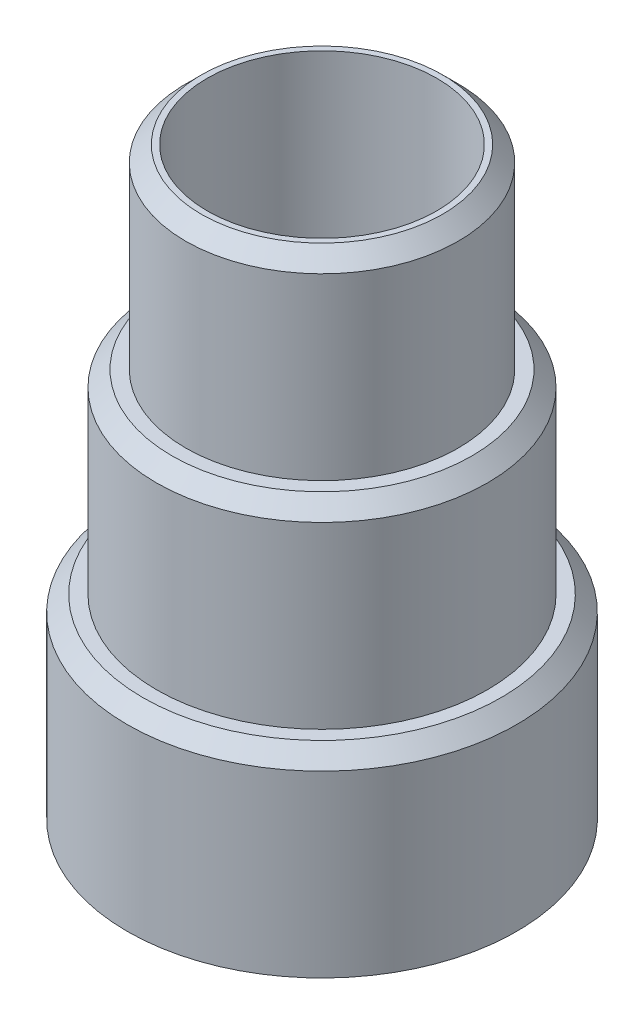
from build123d import *

# Parameters (mm, degrees)
SKETCH1_R                 = 10
BOSS_EXTRUDE1_DEPTH       = 10
SKETCH2_R                 = 8.5
BOSS_EXTRUDE2_DEPTH       = 10
SKETCH3_R                 = 7
BOSS_EXTRUDE3_DEPTH       = 10
SKETCH4_R                 = 5.9
CUT_EXTRUDE1_DEPTH        = 14
M4X0_7_TAPPED_HOLE1_D     = 3.3
M4X0_7_TAPPED_HOLE1_DEPTH = 10.1
M4X0_7_TAPPED_HOLE1_TIP   = 0.991420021
M6X1_0_TAPPED_HOLE1_D     = 5
M6X1_0_TAPPED_HOLE1_DEPTH = 9
M6X1_0_TAPPED_HOLE1_TIP   = 1.502151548
CHAMFER1_SIZE             = 0.8


with BuildPart() as part:
    # Sketch1 → Boss-Extrude1 (new body)
    with BuildSketch(Plane(origin=(0, 0, 0), x_dir=(1, 0, 0), z_dir=(0, 1, 0))):
        with Locations(Location((0, 0, 0), (0, 0, 270))):
            Circle(SKETCH1_R)
    extrude(amount=BOSS_EXTRUDE1_DEPTH)

    # Sketch2 → Boss-Extrude2 (add)
    with BuildSketch(Plane(origin=(0, 10, 0), x_dir=(1, 0, 0), z_dir=(0, 1, 0))):
        with Locations(Location((0, 0, 0), (0, 0, 270))):
            Circle(SKETCH2_R)
    extrude(amount=BOSS_EXTRUDE2_DEPTH)

    # Sketch3 → Boss-Extrude3 (add)
    with BuildSketch(Plane(origin=(0, 20, 0), x_dir=(1, 0, 0), z_dir=(0, 1, 0))):
        with Locations(Location((0, 0, 0), (0, 0, 270))):
            Circle(SKETCH3_R)
    extrude(amount=BOSS_EXTRUDE3_DEPTH)

    # Sketch4 → Cut-Extrude1 (cut)
    with BuildSketch(Plane(origin=(0, 30, 0), x_dir=(1, 0, 0), z_dir=(0, 1, 0))):
        with Locations(Location((0, 0, 0), (0, 0, 270))):
            Circle(SKETCH4_R)
    extrude(amount=-CUT_EXTRUDE1_DEPTH, mode=Mode.SUBTRACT)

    # M4x0.7 Tapped Hole1
    with Locations(Plane(origin=(0, 0, 0), x_dir=(-1, 0, 0), z_dir=(0, -1, 0))):
        with Locations((0, 0)):
            Hole(M4X0_7_TAPPED_HOLE1_D / 2, depth=M4X0_7_TAPPED_HOLE1_DEPTH)
            with Locations((0, 0, -(M4X0_7_TAPPED_HOLE1_DEPTH + M4X0_7_TAPPED_HOLE1_TIP / 2))):  # 118° drill point
                Cone(0, M4X0_7_TAPPED_HOLE1_D / 2, M4X0_7_TAPPED_HOLE1_TIP, mode=Mode.SUBTRACT)

    # M6x1.0 Tapped Hole1
    with Locations(Plane(origin=(0, 16, 0), x_dir=(1, 0, 0), z_dir=(0, 1, 0))):
        with Locations((0, 0)):
            Hole(M6X1_0_TAPPED_HOLE1_D / 2, depth=M6X1_0_TAPPED_HOLE1_DEPTH)
            with Locations((0, 0, -(M6X1_0_TAPPED_HOLE1_DEPTH + M6X1_0_TAPPED_HOLE1_TIP / 2))):  # 118° drill point
                Cone(0, M6X1_0_TAPPED_HOLE1_D / 2, M6X1_0_TAPPED_HOLE1_TIP, mode=Mode.SUBTRACT)

    # Chamfer1
    chamfer1_edges = [part.edges().sort_by_distance(p)[0] for p in [
        (0, 30, -7),
        (0, 10, -10),
        (0, 20, -8.5),
    ]]
    chamfer(chamfer1_edges, length=CHAMFER1_SIZE)


solid = part.part
